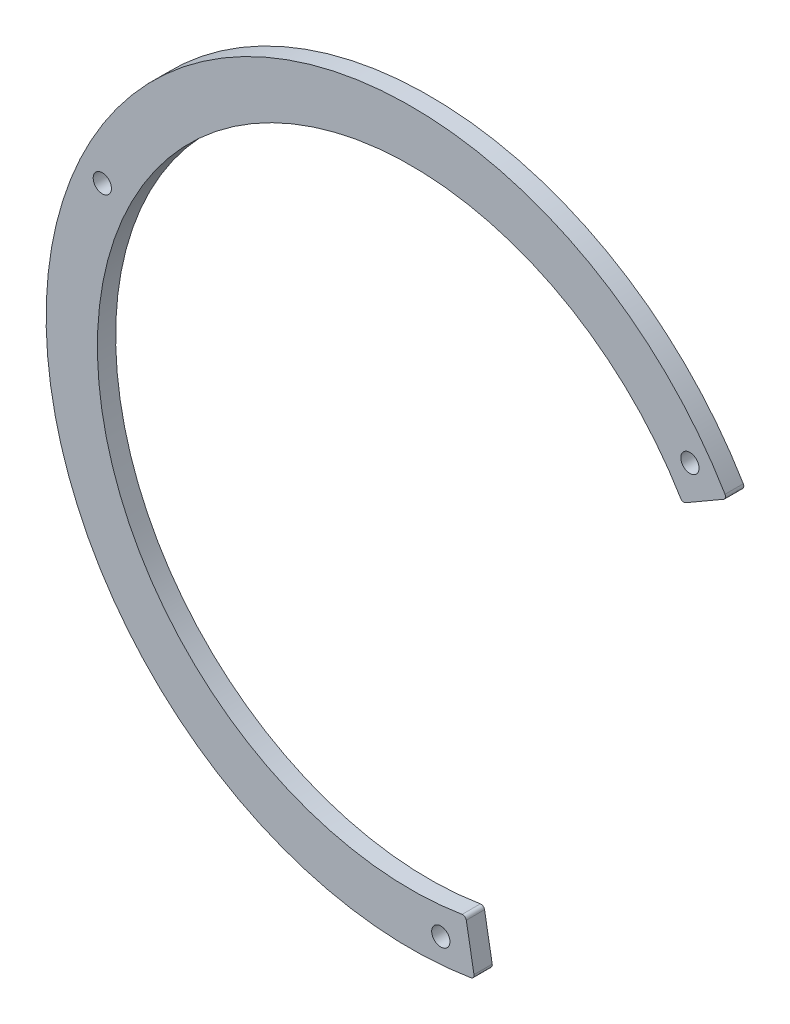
ISO-10303-21;
HEADER;
FILE_DESCRIPTION(('STEP AP214'),'2;1');
FILE_NAME('part.step','',(''),(''),'','','');
FILE_SCHEMA(('AUTOMOTIVE_DESIGN { 1 0 10303 214 1 1 1 1 }'));
ENDSEC;
DATA;
#1=APPLICATION_CONTEXT('core data for automotive mechanical design processes');
#2=APPLICATION_PROTOCOL_DEFINITION('international standard','automotive_design',2000,#1);
#3=PRODUCT_CONTEXT('',#1,'mechanical');
#4=PRODUCT('Part','Part','',(#3));
#5=PRODUCT_RELATED_PRODUCT_CATEGORY('part','',(#4));
#6=PRODUCT_DEFINITION_FORMATION('','',#4);
#7=PRODUCT_DEFINITION_CONTEXT('part definition',#1,'design');
#8=PRODUCT_DEFINITION('design','',#6,#7);
#9=PRODUCT_DEFINITION_SHAPE('','',#8);
#10=(LENGTH_UNIT() NAMED_UNIT(*) SI_UNIT(.MILLI.,.METRE.));
#11=(NAMED_UNIT(*) PLANE_ANGLE_UNIT() SI_UNIT($,.RADIAN.));
#12=(NAMED_UNIT(*) SI_UNIT($,.STERADIAN.) SOLID_ANGLE_UNIT());
#13=UNCERTAINTY_MEASURE_WITH_UNIT(LENGTH_MEASURE(1.E-05),#10,'distance_accuracy_value','');
#14=(GEOMETRIC_REPRESENTATION_CONTEXT(3) GLOBAL_UNCERTAINTY_ASSIGNED_CONTEXT((#13)) GLOBAL_UNIT_ASSIGNED_CONTEXT((#10,
#11,#12)) REPRESENTATION_CONTEXT('',''));
#15=CARTESIAN_POINT('',(0.,0.,0.));
#16=DIRECTION('',(0.,0.,1.));
#17=DIRECTION('',(1.,0.,0.));
#18=AXIS2_PLACEMENT_3D('',#15,#16,#17);
#19=CARTESIAN_POINT('',(0.,0.,5.));
#20=DIRECTION('',(0.,0.,-1.));
#21=DIRECTION('',(-1.,0.,0.));
#22=AXIS2_PLACEMENT_3D('',#19,#20,#21);
#23=PLANE('',#22);
#24=DIRECTION('',(0.865679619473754,0.500598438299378,0.));
#25=VECTOR('',#24,1.);
#26=CARTESIAN_POINT('',(86.5679619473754,50.0598438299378,5.));
#27=LINE('',#26,#25);
#28=CARTESIAN_POINT('',(75.2664796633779,43.5245110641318,5.));
#29=VERTEX_POINT('',#28);
#30=CARTESIAN_POINT('',(85.6979100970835,49.556717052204,5.));
#31=VERTEX_POINT('',#30);
#32=EDGE_CURVE('E142',#29,#31,#27,.T.);
#33=ORIENTED_EDGE('',*,*,#32,.T.);
#34=CARTESIAN_POINT('',(85.1973116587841,50.4223966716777,5.));
#35=DIRECTION('',(0.,0.,-1.));
#36=DIRECTION('',(-1.,0.,0.));
#37=AXIS2_PLACEMENT_3D('',#34,#35,#36);
#38=CIRCLE('',#37,1.);
#39=CARTESIAN_POINT('',(86.0578905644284,50.9317138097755,5.));
#40=VERTEX_POINT('',#39);
#41=EDGE_CURVE('E161',#31,#40,#38,.F.);
#42=ORIENTED_EDGE('',*,*,#41,.T.);
#43=CARTESIAN_POINT('',(0.,0.,5.));
#44=DIRECTION('',(0.,0.,1.));
#45=DIRECTION('',(-1.,0.,0.));
#46=AXIS2_PLACEMENT_3D('',#43,#44,#45);
#47=CIRCLE('',#46,100.);
#48=CARTESIAN_POINT('',(16.4373558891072,-98.6398161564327,5.));
#49=VERTEX_POINT('',#48);
#50=EDGE_CURVE('E125',#40,#49,#47,.T.);
#51=ORIENTED_EDGE('',*,*,#50,.T.);
#52=CARTESIAN_POINT('',(16.2729823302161,-97.6534179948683,5.));
#53=DIRECTION('',(0.,0.,-1.));
#54=DIRECTION('',(-1.,0.,0.));
#55=AXIS2_PLACEMENT_3D('',#52,#53,#54);
#56=CIRCLE('',#55,1.);
#57=CARTESIAN_POINT('',(17.2576698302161,-97.479089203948,5.));
#58=VERTEX_POINT('',#57);
#59=EDGE_CURVE('E156',#49,#58,#56,.F.);
#60=ORIENTED_EDGE('',*,*,#59,.T.);
#61=DIRECTION('',(-0.174328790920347,0.9846875,0.));
#62=VECTOR('',#61,1.);
#63=CARTESIAN_POINT('',(14.9836834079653,-84.6345900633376,5.));
#64=LINE('',#63,#62);
#65=CARTESIAN_POINT('',(15.1570097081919,-85.6136150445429,5.));
#66=VERTEX_POINT('',#65);
#67=EDGE_CURVE('E172',#58,#66,#64,.T.);
#68=ORIENTED_EDGE('',*,*,#67,.T.);
#69=CARTESIAN_POINT('',(14.1723222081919,-85.7879438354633,5.));
#70=DIRECTION('',(0.,0.,-1.));
#71=DIRECTION('',(-1.,0.,0.));
#72=AXIS2_PLACEMENT_3D('',#69,#70,#71);
#73=CIRCLE('',#72,1.);
#74=CARTESIAN_POINT('',(14.0093296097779,-84.8013165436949,5.));
#75=VERTEX_POINT('',#74);
#76=EDGE_CURVE('E61',#66,#75,#73,.F.);
#77=ORIENTED_EDGE('',*,*,#76,.T.);
#78=CARTESIAN_POINT('',(0.,0.,5.));
#79=DIRECTION('',(0.,0.,-1.));
#80=DIRECTION('',(-1.,0.,0.));
#81=AXIS2_PLACEMENT_3D('',#78,#79,#80);
#82=CIRCLE('',#81,85.9507103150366);
#83=CARTESIAN_POINT('',(73.9060161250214,43.8796693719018,5.));
#84=VERTEX_POINT('',#83);
#85=EDGE_CURVE('E180',#75,#84,#82,.T.);
#86=ORIENTED_EDGE('',*,*,#85,.T.);
#87=CARTESIAN_POINT('',(74.7658812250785,44.3901906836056,5.));
#88=DIRECTION('',(0.,0.,-1.));
#89=DIRECTION('',(-1.,0.,0.));
#90=AXIS2_PLACEMENT_3D('',#87,#88,#89);
#91=CIRCLE('',#90,1.);
#92=EDGE_CURVE('E159',#84,#29,#91,.F.);
#93=ORIENTED_EDGE('',*,*,#92,.T.);
#94=EDGE_LOOP('',(#33,#42,#51,#60,#68,#77,#86,#93));
#95=FACE_BOUND('',#94,.T.);
#96=CARTESIAN_POINT('',(76.435686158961,53.5602183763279,5.));
#97=DIRECTION('',(0.,0.,1.));
#98=DIRECTION('',(1.,0.,0.));
#99=AXIS2_PLACEMENT_3D('',#96,#97,#98);
#100=CIRCLE('',#99,2.50000000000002);
#101=CARTESIAN_POINT('',(78.935686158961,53.5602183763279,5.));
#102=VERTEX_POINT('',#101);
#103=EDGE_CURVE('E133',#102,#102,#100,.T.);
#104=ORIENTED_EDGE('',*,*,#103,.F.);
#105=EDGE_LOOP('',(#104));
#106=FACE_BOUND('',#105,.T.);
#107=CARTESIAN_POINT('',(8.16666666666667,-92.9753551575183,5.));
#108=DIRECTION('',(0.,0.,1.));
#109=DIRECTION('',(1.,0.,0.));
#110=AXIS2_PLACEMENT_3D('',#107,#108,#109);
#111=CIRCLE('',#110,2.5);
#112=CARTESIAN_POINT('',(10.6666666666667,-92.9753551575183,5.));
#113=VERTEX_POINT('',#112);
#114=EDGE_CURVE('E187',#113,#113,#111,.T.);
#115=ORIENTED_EDGE('',*,*,#114,.F.);
#116=EDGE_LOOP('',(#115));
#117=FACE_BOUND('',#116,.T.);
#118=CARTESIAN_POINT('',(-84.6023528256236,39.4151367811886,5.));
#119=DIRECTION('',(0.,0.,1.));
#120=DIRECTION('',(1.,0.,0.));
#121=AXIS2_PLACEMENT_3D('',#118,#119,#120);
#122=CIRCLE('',#121,2.50000000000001);
#123=CARTESIAN_POINT('',(-82.1023528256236,39.4151367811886,5.));
#124=VERTEX_POINT('',#123);
#125=EDGE_CURVE('E192',#124,#124,#122,.T.);
#126=ORIENTED_EDGE('',*,*,#125,.F.);
#127=EDGE_LOOP('',(#126));
#128=FACE_BOUND('',#127,.T.);
#129=ADVANCED_FACE('F39',(#95,#106,#117,#128),#23,.F.);
#130=CARTESIAN_POINT('',(0.,0.,0.));
#131=DIRECTION('',(0.,0.,-1.));
#132=DIRECTION('',(-1.,0.,0.));
#133=AXIS2_PLACEMENT_3D('',#130,#131,#132);
#134=PLANE('',#133);
#135=CARTESIAN_POINT('',(8.16666666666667,-92.9753551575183,0.));
#136=DIRECTION('',(0.,0.,1.));
#137=DIRECTION('',(1.,0.,0.));
#138=AXIS2_PLACEMENT_3D('',#135,#136,#137);
#139=CIRCLE('',#138,2.5);
#140=CARTESIAN_POINT('',(10.6666666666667,-92.9753551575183,0.));
#141=VERTEX_POINT('',#140);
#142=EDGE_CURVE('E189',#141,#141,#139,.T.);
#143=ORIENTED_EDGE('',*,*,#142,.T.);
#144=EDGE_LOOP('',(#143));
#145=FACE_BOUND('',#144,.T.);
#146=CARTESIAN_POINT('',(0.,0.,0.));
#147=DIRECTION('',(0.,0.,1.));
#148=DIRECTION('',(-1.,0.,0.));
#149=AXIS2_PLACEMENT_3D('',#146,#147,#148);
#150=CIRCLE('',#149,100.);
#151=CARTESIAN_POINT('',(86.0578905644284,50.9317138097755,0.));
#152=VERTEX_POINT('',#151);
#153=CARTESIAN_POINT('',(16.4373558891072,-98.6398161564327,0.));
#154=VERTEX_POINT('',#153);
#155=EDGE_CURVE('E122',#152,#154,#150,.T.);
#156=ORIENTED_EDGE('',*,*,#155,.F.);
#157=CARTESIAN_POINT('',(85.1973116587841,50.4223966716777,0.));
#158=DIRECTION('',(0.,0.,-1.));
#159=DIRECTION('',(-1.,0.,0.));
#160=AXIS2_PLACEMENT_3D('',#157,#158,#159);
#161=CIRCLE('',#160,1.);
#162=CARTESIAN_POINT('',(85.6979100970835,49.556717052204,0.));
#163=VERTEX_POINT('',#162);
#164=EDGE_CURVE('E105',#152,#163,#161,.T.);
#165=ORIENTED_EDGE('',*,*,#164,.T.);
#166=DIRECTION('',(0.865679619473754,0.500598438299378,0.));
#167=VECTOR('',#166,1.);
#168=CARTESIAN_POINT('',(86.5679619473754,50.0598438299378,0.));
#169=LINE('',#168,#167);
#170=CARTESIAN_POINT('',(75.2664796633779,43.5245110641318,0.));
#171=VERTEX_POINT('',#170);
#172=EDGE_CURVE('E146',#171,#163,#169,.T.);
#173=ORIENTED_EDGE('',*,*,#172,.F.);
#174=CARTESIAN_POINT('',(74.7658812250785,44.3901906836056,0.));
#175=DIRECTION('',(0.,0.,-1.));
#176=DIRECTION('',(-1.,0.,0.));
#177=AXIS2_PLACEMENT_3D('',#174,#175,#176);
#178=CIRCLE('',#177,1.);
#179=CARTESIAN_POINT('',(73.9060161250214,43.8796693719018,0.));
#180=VERTEX_POINT('',#179);
#181=EDGE_CURVE('E116',#171,#180,#178,.T.);
#182=ORIENTED_EDGE('',*,*,#181,.T.);
#183=CARTESIAN_POINT('',(0.,0.,0.));
#184=DIRECTION('',(0.,0.,-1.));
#185=DIRECTION('',(-1.,0.,0.));
#186=AXIS2_PLACEMENT_3D('',#183,#184,#185);
#187=CIRCLE('',#186,85.9507103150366);
#188=CARTESIAN_POINT('',(14.0093296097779,-84.8013165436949,0.));
#189=VERTEX_POINT('',#188);
#190=EDGE_CURVE('E136',#189,#180,#187,.T.);
#191=ORIENTED_EDGE('',*,*,#190,.F.);
#192=CARTESIAN_POINT('',(14.1723222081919,-85.7879438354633,0.));
#193=DIRECTION('',(0.,0.,-1.));
#194=DIRECTION('',(-1.,0.,0.));
#195=AXIS2_PLACEMENT_3D('',#192,#193,#194);
#196=CIRCLE('',#195,1.);
#197=CARTESIAN_POINT('',(15.1570097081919,-85.6136150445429,0.));
#198=VERTEX_POINT('',#197);
#199=EDGE_CURVE('E150',#189,#198,#196,.T.);
#200=ORIENTED_EDGE('',*,*,#199,.T.);
#201=DIRECTION('',(-0.174328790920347,0.9846875,0.));
#202=VECTOR('',#201,1.);
#203=CARTESIAN_POINT('',(14.9836834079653,-84.6345900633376,0.));
#204=LINE('',#203,#202);
#205=CARTESIAN_POINT('',(17.2576698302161,-97.479089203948,0.));
#206=VERTEX_POINT('',#205);
#207=EDGE_CURVE('E132',#206,#198,#204,.T.);
#208=ORIENTED_EDGE('',*,*,#207,.F.);
#209=CARTESIAN_POINT('',(16.2729823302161,-97.6534179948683,0.));
#210=DIRECTION('',(0.,0.,-1.));
#211=DIRECTION('',(-1.,0.,0.));
#212=AXIS2_PLACEMENT_3D('',#209,#210,#211);
#213=CIRCLE('',#212,1.);
#214=EDGE_CURVE('E126',#206,#154,#213,.T.);
#215=ORIENTED_EDGE('',*,*,#214,.T.);
#216=EDGE_LOOP('',(#156,#165,#173,#182,#191,#200,#208,#215));
#217=FACE_BOUND('',#216,.T.);
#218=CARTESIAN_POINT('',(76.435686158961,53.5602183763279,0.));
#219=DIRECTION('',(0.,0.,1.));
#220=DIRECTION('',(1.,0.,0.));
#221=AXIS2_PLACEMENT_3D('',#218,#219,#220);
#222=CIRCLE('',#221,2.50000000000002);
#223=CARTESIAN_POINT('',(78.935686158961,53.5602183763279,0.));
#224=VERTEX_POINT('',#223);
#225=EDGE_CURVE('E139',#224,#224,#222,.T.);
#226=ORIENTED_EDGE('',*,*,#225,.T.);
#227=EDGE_LOOP('',(#226));
#228=FACE_BOUND('',#227,.T.);
#229=CARTESIAN_POINT('',(-84.6023528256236,39.4151367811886,0.));
#230=DIRECTION('',(0.,0.,1.));
#231=DIRECTION('',(1.,0.,0.));
#232=AXIS2_PLACEMENT_3D('',#229,#230,#231);
#233=CIRCLE('',#232,2.50000000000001);
#234=CARTESIAN_POINT('',(-82.1023528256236,39.4151367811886,0.));
#235=VERTEX_POINT('',#234);
#236=EDGE_CURVE('E195',#235,#235,#233,.T.);
#237=ORIENTED_EDGE('',*,*,#236,.T.);
#238=EDGE_LOOP('',(#237));
#239=FACE_BOUND('',#238,.T.);
#240=ADVANCED_FACE('F129',(#145,#217,#228,#239),#134,.T.);
#241=CARTESIAN_POINT('',(0.,0.,5.));
#242=DIRECTION('',(0.,0.,-1.));
#243=DIRECTION('',(-1.,0.,0.));
#244=AXIS2_PLACEMENT_3D('',#241,#242,#243);
#245=CYLINDRICAL_SURFACE('',#244,100.);
#246=ORIENTED_EDGE('',*,*,#50,.F.);
#247=DIRECTION('',(0.,0.,-1.));
#248=VECTOR('',#247,1.);
#249=CARTESIAN_POINT('',(86.0578905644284,50.9317138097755,5.));
#250=LINE('',#249,#248);
#251=EDGE_CURVE('E109',#40,#152,#250,.T.);
#252=ORIENTED_EDGE('',*,*,#251,.T.);
#253=ORIENTED_EDGE('',*,*,#155,.T.);
#254=DIRECTION('',(0.,0.,-1.));
#255=VECTOR('',#254,1.);
#256=CARTESIAN_POINT('',(16.4373558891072,-98.6398161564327,5.));
#257=LINE('',#256,#255);
#258=EDGE_CURVE('E127',#154,#49,#257,.F.);
#259=ORIENTED_EDGE('',*,*,#258,.T.);
#260=EDGE_LOOP('',(#246,#252,#253,#259));
#261=FACE_BOUND('',#260,.T.);
#262=ADVANCED_FACE('F121',(#261),#245,.T.);
#263=CARTESIAN_POINT('',(14.9836834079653,-84.6345900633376,5.));
#264=DIRECTION('',(-0.9846875,-0.174328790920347,0.));
#265=DIRECTION('',(0.174328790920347,-0.9846875,0.));
#266=AXIS2_PLACEMENT_3D('',#263,#264,#265);
#267=PLANE('',#266);
#268=ORIENTED_EDGE('',*,*,#207,.T.);
#269=DIRECTION('',(0.,0.,-1.));
#270=VECTOR('',#269,1.);
#271=CARTESIAN_POINT('',(15.1570097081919,-85.6136150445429,5.));
#272=LINE('',#271,#270);
#273=EDGE_CURVE('E11',#198,#66,#272,.F.);
#274=ORIENTED_EDGE('',*,*,#273,.T.);
#275=ORIENTED_EDGE('',*,*,#67,.F.);
#276=DIRECTION('',(0.,0.,-1.));
#277=VECTOR('',#276,1.);
#278=CARTESIAN_POINT('',(17.2576698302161,-97.479089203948,5.));
#279=LINE('',#278,#277);
#280=EDGE_CURVE('E47',#58,#206,#279,.T.);
#281=ORIENTED_EDGE('',*,*,#280,.T.);
#282=EDGE_LOOP('',(#268,#274,#275,#281));
#283=FACE_BOUND('',#282,.T.);
#284=ADVANCED_FACE('F170',(#283),#267,.F.);
#285=CARTESIAN_POINT('',(0.,0.,5.));
#286=DIRECTION('',(0.,0.,-1.));
#287=DIRECTION('',(-1.,0.,0.));
#288=AXIS2_PLACEMENT_3D('',#285,#286,#287);
#289=CYLINDRICAL_SURFACE('',#288,85.9507103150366);
#290=ORIENTED_EDGE('',*,*,#190,.T.);
#291=DIRECTION('',(0.,0.,-1.));
#292=VECTOR('',#291,1.);
#293=CARTESIAN_POINT('',(73.9060161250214,43.8796693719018,5.));
#294=LINE('',#293,#292);
#295=EDGE_CURVE('E54',#180,#84,#294,.F.);
#296=ORIENTED_EDGE('',*,*,#295,.T.);
#297=ORIENTED_EDGE('',*,*,#85,.F.);
#298=DIRECTION('',(0.,0.,-1.));
#299=VECTOR('',#298,1.);
#300=CARTESIAN_POINT('',(14.0093296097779,-84.8013165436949,5.));
#301=LINE('',#300,#299);
#302=EDGE_CURVE('E163',#75,#189,#301,.T.);
#303=ORIENTED_EDGE('',*,*,#302,.T.);
#304=EDGE_LOOP('',(#290,#296,#297,#303));
#305=FACE_BOUND('',#304,.T.);
#306=ADVANCED_FACE('F179',(#305),#289,.F.);
#307=CARTESIAN_POINT('',(86.5679619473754,50.0598438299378,5.));
#308=DIRECTION('',(-0.500598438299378,0.865679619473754,0.));
#309=DIRECTION('',(-0.865679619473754,-0.500598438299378,0.));
#310=AXIS2_PLACEMENT_3D('',#307,#308,#309);
#311=PLANE('',#310);
#312=ORIENTED_EDGE('',*,*,#172,.T.);
#313=DIRECTION('',(0.,0.,-1.));
#314=VECTOR('',#313,1.);
#315=CARTESIAN_POINT('',(85.6979100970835,49.556717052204,5.));
#316=LINE('',#315,#314);
#317=EDGE_CURVE('E110',#163,#31,#316,.F.);
#318=ORIENTED_EDGE('',*,*,#317,.T.);
#319=ORIENTED_EDGE('',*,*,#32,.F.);
#320=DIRECTION('',(0.,0.,-1.));
#321=VECTOR('',#320,1.);
#322=CARTESIAN_POINT('',(75.2664796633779,43.5245110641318,5.));
#323=LINE('',#322,#321);
#324=EDGE_CURVE('E115',#29,#171,#323,.T.);
#325=ORIENTED_EDGE('',*,*,#324,.T.);
#326=EDGE_LOOP('',(#312,#318,#319,#325));
#327=FACE_BOUND('',#326,.T.);
#328=ADVANCED_FACE('F216',(#327),#311,.F.);
#329=CARTESIAN_POINT('',(76.435686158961,53.5602183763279,5.));
#330=DIRECTION('',(0.,0.,-1.));
#331=DIRECTION('',(-1.,0.,0.));
#332=AXIS2_PLACEMENT_3D('',#329,#330,#331);
#333=CYLINDRICAL_SURFACE('',#332,2.50000000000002);
#334=ORIENTED_EDGE('',*,*,#103,.T.);
#335=EDGE_LOOP('',(#334));
#336=FACE_BOUND('',#335,.T.);
#337=ORIENTED_EDGE('',*,*,#225,.F.);
#338=EDGE_LOOP('',(#337));
#339=FACE_BOUND('',#338,.T.);
#340=ADVANCED_FACE('F213',(#336,#339),#333,.F.);
#341=CARTESIAN_POINT('',(8.16666666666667,-92.9753551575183,5.));
#342=DIRECTION('',(0.,0.,-1.));
#343=DIRECTION('',(-1.,0.,0.));
#344=AXIS2_PLACEMENT_3D('',#341,#342,#343);
#345=CYLINDRICAL_SURFACE('',#344,2.5);
#346=ORIENTED_EDGE('',*,*,#114,.T.);
#347=EDGE_LOOP('',(#346));
#348=FACE_BOUND('',#347,.T.);
#349=ORIENTED_EDGE('',*,*,#142,.F.);
#350=EDGE_LOOP('',(#349));
#351=FACE_BOUND('',#350,.T.);
#352=ADVANCED_FACE('F310',(#348,#351),#345,.F.);
#353=CARTESIAN_POINT('',(-84.6023528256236,39.4151367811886,5.));
#354=DIRECTION('',(0.,0.,-1.));
#355=DIRECTION('',(-1.,0.,0.));
#356=AXIS2_PLACEMENT_3D('',#353,#354,#355);
#357=CYLINDRICAL_SURFACE('',#356,2.50000000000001);
#358=ORIENTED_EDGE('',*,*,#125,.T.);
#359=EDGE_LOOP('',(#358));
#360=FACE_BOUND('',#359,.T.);
#361=ORIENTED_EDGE('',*,*,#236,.F.);
#362=EDGE_LOOP('',(#361));
#363=FACE_BOUND('',#362,.T.);
#364=ADVANCED_FACE('F201',(#360,#363),#357,.F.);
#365=CARTESIAN_POINT('',(85.1973116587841,50.4223966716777,5.));
#366=DIRECTION('',(0.,0.,-1.));
#367=DIRECTION('',(-1.,0.,0.));
#368=AXIS2_PLACEMENT_3D('',#365,#366,#367);
#369=CYLINDRICAL_SURFACE('',#368,1.);
#370=ORIENTED_EDGE('',*,*,#41,.F.);
#371=ORIENTED_EDGE('',*,*,#317,.F.);
#372=ORIENTED_EDGE('',*,*,#164,.F.);
#373=ORIENTED_EDGE('',*,*,#251,.F.);
#374=EDGE_LOOP('',(#370,#371,#372,#373));
#375=FACE_BOUND('',#374,.T.);
#376=ADVANCED_FACE('F108',(#375),#369,.T.);
#377=CARTESIAN_POINT('',(74.7658812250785,44.3901906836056,5.));
#378=DIRECTION('',(0.,0.,-1.));
#379=DIRECTION('',(-1.,0.,0.));
#380=AXIS2_PLACEMENT_3D('',#377,#378,#379);
#381=CYLINDRICAL_SURFACE('',#380,1.);
#382=ORIENTED_EDGE('',*,*,#92,.F.);
#383=ORIENTED_EDGE('',*,*,#295,.F.);
#384=ORIENTED_EDGE('',*,*,#181,.F.);
#385=ORIENTED_EDGE('',*,*,#324,.F.);
#386=EDGE_LOOP('',(#382,#383,#384,#385));
#387=FACE_BOUND('',#386,.T.);
#388=ADVANCED_FACE('F228',(#387),#381,.T.);
#389=CARTESIAN_POINT('',(14.1723222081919,-85.7879438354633,5.));
#390=DIRECTION('',(0.,0.,-1.));
#391=DIRECTION('',(-1.,0.,0.));
#392=AXIS2_PLACEMENT_3D('',#389,#390,#391);
#393=CYLINDRICAL_SURFACE('',#392,1.);
#394=ORIENTED_EDGE('',*,*,#76,.F.);
#395=ORIENTED_EDGE('',*,*,#273,.F.);
#396=ORIENTED_EDGE('',*,*,#199,.F.);
#397=ORIENTED_EDGE('',*,*,#302,.F.);
#398=EDGE_LOOP('',(#394,#395,#396,#397));
#399=FACE_BOUND('',#398,.T.);
#400=ADVANCED_FACE('F178',(#399),#393,.T.);
#401=CARTESIAN_POINT('',(16.2729823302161,-97.6534179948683,5.));
#402=DIRECTION('',(0.,0.,-1.));
#403=DIRECTION('',(-1.,0.,0.));
#404=AXIS2_PLACEMENT_3D('',#401,#402,#403);
#405=CYLINDRICAL_SURFACE('',#404,1.);
#406=ORIENTED_EDGE('',*,*,#59,.F.);
#407=ORIENTED_EDGE('',*,*,#258,.F.);
#408=ORIENTED_EDGE('',*,*,#214,.F.);
#409=ORIENTED_EDGE('',*,*,#280,.F.);
#410=EDGE_LOOP('',(#406,#407,#408,#409));
#411=FACE_BOUND('',#410,.T.);
#412=ADVANCED_FACE('F41',(#411),#405,.T.);
#413=CLOSED_SHELL('',(#129,#240,#262,#284,#306,#328,#340,#352,#364,#376,#388,#400,#412));
#414=MANIFOLD_SOLID_BREP('B2',#413);
#415=ADVANCED_BREP_SHAPE_REPRESENTATION('',(#18,#414),#14);
#416=SHAPE_DEFINITION_REPRESENTATION(#9,#415);
ENDSEC;
END-ISO-10303-21;
